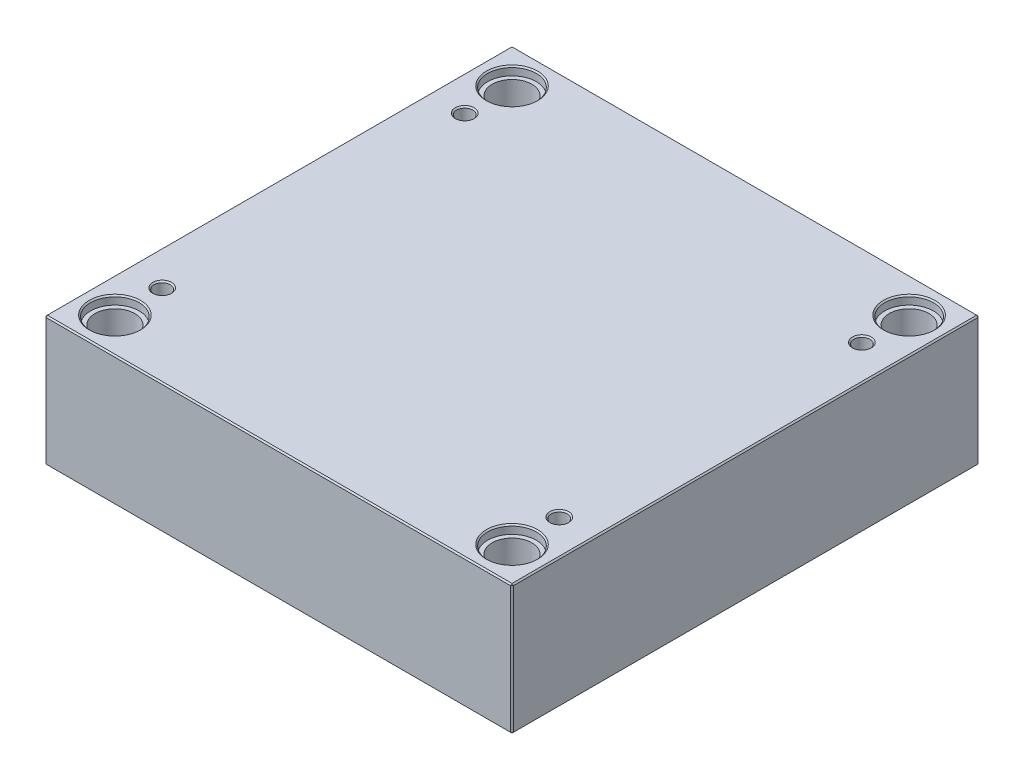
ISO-10303-21;
HEADER;
FILE_DESCRIPTION(('STEP AP214'),'2;1');
FILE_NAME('part.step','',(''),(''),'','','');
FILE_SCHEMA(('AUTOMOTIVE_DESIGN { 1 0 10303 214 1 1 1 1 }'));
ENDSEC;
DATA;
#1=APPLICATION_CONTEXT('core data for automotive mechanical design processes');
#2=APPLICATION_PROTOCOL_DEFINITION('international standard','automotive_design',2000,#1);
#3=PRODUCT_CONTEXT('',#1,'mechanical');
#4=PRODUCT('Part','Part','',(#3));
#5=PRODUCT_RELATED_PRODUCT_CATEGORY('part','',(#4));
#6=PRODUCT_DEFINITION_FORMATION('','',#4);
#7=PRODUCT_DEFINITION_CONTEXT('part definition',#1,'design');
#8=PRODUCT_DEFINITION('design','',#6,#7);
#9=PRODUCT_DEFINITION_SHAPE('','',#8);
#10=(LENGTH_UNIT() NAMED_UNIT(*) SI_UNIT(.MILLI.,.METRE.));
#11=(NAMED_UNIT(*) PLANE_ANGLE_UNIT() SI_UNIT($,.RADIAN.));
#12=(NAMED_UNIT(*) SI_UNIT($,.STERADIAN.) SOLID_ANGLE_UNIT());
#13=UNCERTAINTY_MEASURE_WITH_UNIT(LENGTH_MEASURE(1.E-05),#10,'distance_accuracy_value','');
#14=(GEOMETRIC_REPRESENTATION_CONTEXT(3) GLOBAL_UNCERTAINTY_ASSIGNED_CONTEXT((#13)) GLOBAL_UNIT_ASSIGNED_CONTEXT((#10,
#11,#12)) REPRESENTATION_CONTEXT('',''));
#15=CARTESIAN_POINT('',(0.,0.,0.));
#16=DIRECTION('',(0.,0.,1.));
#17=DIRECTION('',(1.,0.,0.));
#18=AXIS2_PLACEMENT_3D('',#15,#16,#17);
#19=CARTESIAN_POINT('',(-147.,0.,-147.));
#20=DIRECTION('',(0.,1.,0.));
#21=DIRECTION('',(0.,0.,1.));
#22=AXIS2_PLACEMENT_3D('',#19,#20,#21);
#23=CYLINDRICAL_SURFACE('',#22,14.7);
#24=CARTESIAN_POINT('',(-147.,0.999999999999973,-147.));
#25=DIRECTION('',(0.,1.,0.));
#26=DIRECTION('',(0.,0.,1.));
#27=AXIS2_PLACEMENT_3D('',#24,#25,#26);
#28=CIRCLE('',#27,14.7);
#29=CARTESIAN_POINT('',(-147.,0.999999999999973,-132.3));
#30=VERTEX_POINT('',#29);
#31=EDGE_CURVE('E471',#30,#30,#28,.F.);
#32=ORIENTED_EDGE('',*,*,#31,.T.);
#33=EDGE_LOOP('',(#32));
#34=FACE_BOUND('',#33,.T.);
#35=CARTESIAN_POINT('',(-147.,89.7,-147.));
#36=DIRECTION('',(0.,1.,0.));
#37=DIRECTION('',(0.,0.,1.));
#38=AXIS2_PLACEMENT_3D('',#35,#36,#37);
#39=CIRCLE('',#38,14.7);
#40=CARTESIAN_POINT('',(-147.,89.7,-132.3));
#41=VERTEX_POINT('',#40);
#42=EDGE_CURVE('E220',#41,#41,#39,.F.);
#43=ORIENTED_EDGE('',*,*,#42,.F.);
#44=EDGE_LOOP('',(#43));
#45=FACE_BOUND('',#44,.T.);
#46=ADVANCED_FACE('F15',(#34,#45),#23,.F.);
#47=CARTESIAN_POINT('',(147.,0.,-147.));
#48=DIRECTION('',(0.,1.,0.));
#49=DIRECTION('',(0.,0.,1.));
#50=AXIS2_PLACEMENT_3D('',#47,#48,#49);
#51=CYLINDRICAL_SURFACE('',#50,14.7);
#52=CARTESIAN_POINT('',(147.,0.999999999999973,-147.));
#53=DIRECTION('',(0.,1.,0.));
#54=DIRECTION('',(0.,0.,1.));
#55=AXIS2_PLACEMENT_3D('',#52,#53,#54);
#56=CIRCLE('',#55,14.7);
#57=CARTESIAN_POINT('',(147.,0.999999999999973,-132.3));
#58=VERTEX_POINT('',#57);
#59=EDGE_CURVE('E473',#58,#58,#56,.F.);
#60=ORIENTED_EDGE('',*,*,#59,.T.);
#61=EDGE_LOOP('',(#60));
#62=FACE_BOUND('',#61,.T.);
#63=CARTESIAN_POINT('',(147.,89.7,-147.));
#64=DIRECTION('',(0.,1.,0.));
#65=DIRECTION('',(0.,0.,1.));
#66=AXIS2_PLACEMENT_3D('',#63,#64,#65);
#67=CIRCLE('',#66,14.7);
#68=CARTESIAN_POINT('',(147.,89.7,-132.3));
#69=VERTEX_POINT('',#68);
#70=EDGE_CURVE('E217',#69,#69,#67,.F.);
#71=ORIENTED_EDGE('',*,*,#70,.F.);
#72=EDGE_LOOP('',(#71));
#73=FACE_BOUND('',#72,.T.);
#74=ADVANCED_FACE('F262',(#62,#73),#51,.F.);
#75=CARTESIAN_POINT('',(147.,0.,147.));
#76=DIRECTION('',(0.,1.,0.));
#77=DIRECTION('',(0.,0.,1.));
#78=AXIS2_PLACEMENT_3D('',#75,#76,#77);
#79=CYLINDRICAL_SURFACE('',#78,14.7);
#80=CARTESIAN_POINT('',(147.,0.999999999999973,147.));
#81=DIRECTION('',(0.,1.,0.));
#82=DIRECTION('',(0.,0.,1.));
#83=AXIS2_PLACEMENT_3D('',#80,#81,#82);
#84=CIRCLE('',#83,14.7);
#85=CARTESIAN_POINT('',(147.,0.999999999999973,161.7));
#86=VERTEX_POINT('',#85);
#87=EDGE_CURVE('E476',#86,#86,#84,.F.);
#88=ORIENTED_EDGE('',*,*,#87,.T.);
#89=EDGE_LOOP('',(#88));
#90=FACE_BOUND('',#89,.T.);
#91=CARTESIAN_POINT('',(147.,89.7,147.));
#92=DIRECTION('',(0.,1.,0.));
#93=DIRECTION('',(0.,0.,1.));
#94=AXIS2_PLACEMENT_3D('',#91,#92,#93);
#95=CIRCLE('',#94,14.7);
#96=CARTESIAN_POINT('',(147.,89.7,161.7));
#97=VERTEX_POINT('',#96);
#98=EDGE_CURVE('E213',#97,#97,#95,.F.);
#99=ORIENTED_EDGE('',*,*,#98,.F.);
#100=EDGE_LOOP('',(#99));
#101=FACE_BOUND('',#100,.T.);
#102=ADVANCED_FACE('F269',(#90,#101),#79,.F.);
#103=CARTESIAN_POINT('',(-147.,0.,147.));
#104=DIRECTION('',(0.,1.,0.));
#105=DIRECTION('',(0.,0.,1.));
#106=AXIS2_PLACEMENT_3D('',#103,#104,#105);
#107=CYLINDRICAL_SURFACE('',#106,14.7);
#108=CARTESIAN_POINT('',(-147.,0.999999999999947,147.));
#109=DIRECTION('',(0.,1.,0.));
#110=DIRECTION('',(0.,0.,1.));
#111=AXIS2_PLACEMENT_3D('',#108,#109,#110);
#112=CIRCLE('',#111,14.7);
#113=CARTESIAN_POINT('',(-147.,0.999999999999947,161.7));
#114=VERTEX_POINT('',#113);
#115=EDGE_CURVE('E479',#114,#114,#112,.F.);
#116=ORIENTED_EDGE('',*,*,#115,.T.);
#117=EDGE_LOOP('',(#116));
#118=FACE_BOUND('',#117,.T.);
#119=CARTESIAN_POINT('',(-147.,89.7,147.));
#120=DIRECTION('',(0.,1.,0.));
#121=DIRECTION('',(0.,0.,1.));
#122=AXIS2_PLACEMENT_3D('',#119,#120,#121);
#123=CIRCLE('',#122,14.7);
#124=CARTESIAN_POINT('',(-147.,89.7,161.7));
#125=VERTEX_POINT('',#124);
#126=EDGE_CURVE('E210',#125,#125,#123,.F.);
#127=ORIENTED_EDGE('',*,*,#126,.F.);
#128=EDGE_LOOP('',(#127));
#129=FACE_BOUND('',#128,.T.);
#130=ADVANCED_FACE('F276',(#118,#129),#107,.F.);
#131=CARTESIAN_POINT('',(-173.,96.,173.));
#132=DIRECTION('',(1.,0.,0.));
#133=DIRECTION('',(0.,0.,-1.));
#134=AXIS2_PLACEMENT_3D('',#131,#132,#133);
#135=PLANE('',#134);
#136=DIRECTION('',(0.,-1.,0.));
#137=VECTOR('',#136,1.);
#138=CARTESIAN_POINT('',(-173.,96.,-172.));
#139=LINE('',#138,#137);
#140=CARTESIAN_POINT('',(-173.,95.,-172.));
#141=VERTEX_POINT('',#140);
#142=CARTESIAN_POINT('',(-173.,0.999999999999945,-172.));
#143=VERTEX_POINT('',#142);
#144=EDGE_CURVE('E486',#141,#143,#139,.T.);
#145=ORIENTED_EDGE('',*,*,#144,.T.);
#146=DIRECTION('',(0.,0.,1.));
#147=VECTOR('',#146,1.);
#148=CARTESIAN_POINT('',(-173.,0.999999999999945,173.));
#149=LINE('',#148,#147);
#150=CARTESIAN_POINT('',(-173.,0.999999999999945,172.));
#151=VERTEX_POINT('',#150);
#152=EDGE_CURVE('E489',#143,#151,#149,.T.);
#153=ORIENTED_EDGE('',*,*,#152,.T.);
#154=DIRECTION('',(0.,1.,0.));
#155=VECTOR('',#154,1.);
#156=CARTESIAN_POINT('',(-173.,96.,172.));
#157=LINE('',#156,#155);
#158=CARTESIAN_POINT('',(-173.,95.,172.));
#159=VERTEX_POINT('',#158);
#160=EDGE_CURVE('E484',#151,#159,#157,.T.);
#161=ORIENTED_EDGE('',*,*,#160,.T.);
#162=DIRECTION('',(0.,0.,-1.));
#163=VECTOR('',#162,1.);
#164=CARTESIAN_POINT('',(-173.,95.,-173.));
#165=LINE('',#164,#163);
#166=EDGE_CURVE('E482',#159,#141,#165,.T.);
#167=ORIENTED_EDGE('',*,*,#166,.T.);
#168=EDGE_LOOP('',(#145,#153,#161,#167));
#169=FACE_BOUND('',#168,.T.);
#170=ADVANCED_FACE('F297',(#169),#135,.F.);
#171=CARTESIAN_POINT('',(173.,96.,173.));
#172=DIRECTION('',(0.,0.,-1.));
#173=DIRECTION('',(-1.,0.,0.));
#174=AXIS2_PLACEMENT_3D('',#171,#172,#173);
#175=PLANE('',#174);
#176=DIRECTION('',(-1.,0.,0.));
#177=VECTOR('',#176,1.);
#178=CARTESIAN_POINT('',(-173.,95.,173.));
#179=LINE('',#178,#177);
#180=CARTESIAN_POINT('',(172.,95.,173.));
#181=VERTEX_POINT('',#180);
#182=CARTESIAN_POINT('',(-172.,95.,173.));
#183=VERTEX_POINT('',#182);
#184=EDGE_CURVE('E508',#181,#183,#179,.T.);
#185=ORIENTED_EDGE('',*,*,#184,.T.);
#186=DIRECTION('',(0.,-1.,0.));
#187=VECTOR('',#186,1.);
#188=CARTESIAN_POINT('',(-172.,96.,173.));
#189=LINE('',#188,#187);
#190=CARTESIAN_POINT('',(-172.,0.999999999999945,173.));
#191=VERTEX_POINT('',#190);
#192=EDGE_CURVE('E514',#183,#191,#189,.T.);
#193=ORIENTED_EDGE('',*,*,#192,.T.);
#194=DIRECTION('',(1.,0.,0.));
#195=VECTOR('',#194,1.);
#196=CARTESIAN_POINT('',(173.,0.999999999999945,173.));
#197=LINE('',#196,#195);
#198=CARTESIAN_POINT('',(172.,0.999999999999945,173.));
#199=VERTEX_POINT('',#198);
#200=EDGE_CURVE('E512',#191,#199,#197,.T.);
#201=ORIENTED_EDGE('',*,*,#200,.T.);
#202=DIRECTION('',(0.,1.,0.));
#203=VECTOR('',#202,1.);
#204=CARTESIAN_POINT('',(172.,96.,173.));
#205=LINE('',#204,#203);
#206=EDGE_CURVE('E510',#199,#181,#205,.T.);
#207=ORIENTED_EDGE('',*,*,#206,.T.);
#208=EDGE_LOOP('',(#185,#193,#201,#207));
#209=FACE_BOUND('',#208,.T.);
#210=ADVANCED_FACE('F293',(#209),#175,.F.);
#211=CARTESIAN_POINT('',(173.,96.,173.));
#212=DIRECTION('',(-1.,0.,0.));
#213=DIRECTION('',(0.,0.,1.));
#214=AXIS2_PLACEMENT_3D('',#211,#212,#213);
#215=PLANE('',#214);
#216=DIRECTION('',(0.,0.,-1.));
#217=VECTOR('',#216,1.);
#218=CARTESIAN_POINT('',(173.,0.999999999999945,173.));
#219=LINE('',#218,#217);
#220=CARTESIAN_POINT('',(173.,0.999999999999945,172.));
#221=VERTEX_POINT('',#220);
#222=CARTESIAN_POINT('',(173.,0.999999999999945,-172.));
#223=VERTEX_POINT('',#222);
#224=EDGE_CURVE('E503',#221,#223,#219,.T.);
#225=ORIENTED_EDGE('',*,*,#224,.T.);
#226=DIRECTION('',(0.,1.,0.));
#227=VECTOR('',#226,1.);
#228=CARTESIAN_POINT('',(173.,96.,-172.));
#229=LINE('',#228,#227);
#230=CARTESIAN_POINT('',(173.,95.,-172.));
#231=VERTEX_POINT('',#230);
#232=EDGE_CURVE('E505',#223,#231,#229,.T.);
#233=ORIENTED_EDGE('',*,*,#232,.T.);
#234=DIRECTION('',(0.,0.,1.));
#235=VECTOR('',#234,1.);
#236=CARTESIAN_POINT('',(173.,95.,173.));
#237=LINE('',#236,#235);
#238=CARTESIAN_POINT('',(173.,95.,172.));
#239=VERTEX_POINT('',#238);
#240=EDGE_CURVE('E499',#231,#239,#237,.T.);
#241=ORIENTED_EDGE('',*,*,#240,.T.);
#242=DIRECTION('',(0.,-1.,0.));
#243=VECTOR('',#242,1.);
#244=CARTESIAN_POINT('',(173.,96.,172.));
#245=LINE('',#244,#243);
#246=EDGE_CURVE('E501',#239,#221,#245,.T.);
#247=ORIENTED_EDGE('',*,*,#246,.T.);
#248=EDGE_LOOP('',(#225,#233,#241,#247));
#249=FACE_BOUND('',#248,.T.);
#250=ADVANCED_FACE('F289',(#249),#215,.F.);
#251=CARTESIAN_POINT('',(173.,96.,-173.));
#252=DIRECTION('',(0.,0.,1.));
#253=DIRECTION('',(1.,0.,0.));
#254=AXIS2_PLACEMENT_3D('',#251,#252,#253);
#255=PLANE('',#254);
#256=DIRECTION('',(0.,-1.,0.));
#257=VECTOR('',#256,1.);
#258=CARTESIAN_POINT('',(172.,96.,-173.));
#259=LINE('',#258,#257);
#260=CARTESIAN_POINT('',(172.,95.,-173.));
#261=VERTEX_POINT('',#260);
#262=CARTESIAN_POINT('',(172.,0.999999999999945,-173.));
#263=VERTEX_POINT('',#262);
#264=EDGE_CURVE('E493',#261,#263,#259,.T.);
#265=ORIENTED_EDGE('',*,*,#264,.T.);
#266=DIRECTION('',(-1.,0.,0.));
#267=VECTOR('',#266,1.);
#268=CARTESIAN_POINT('',(173.,0.999999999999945,-173.));
#269=LINE('',#268,#267);
#270=CARTESIAN_POINT('',(-172.,0.999999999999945,-173.));
#271=VERTEX_POINT('',#270);
#272=EDGE_CURVE('E137',#263,#271,#269,.T.);
#273=ORIENTED_EDGE('',*,*,#272,.T.);
#274=DIRECTION('',(0.,1.,0.));
#275=VECTOR('',#274,1.);
#276=CARTESIAN_POINT('',(-172.,96.,-173.));
#277=LINE('',#276,#275);
#278=CARTESIAN_POINT('',(-172.,95.,-173.));
#279=VERTEX_POINT('',#278);
#280=EDGE_CURVE('E495',#271,#279,#277,.T.);
#281=ORIENTED_EDGE('',*,*,#280,.T.);
#282=DIRECTION('',(1.,0.,0.));
#283=VECTOR('',#282,1.);
#284=CARTESIAN_POINT('',(173.,95.,-173.));
#285=LINE('',#284,#283);
#286=EDGE_CURVE('E491',#279,#261,#285,.T.);
#287=ORIENTED_EDGE('',*,*,#286,.T.);
#288=EDGE_LOOP('',(#265,#273,#281,#287));
#289=FACE_BOUND('',#288,.T.);
#290=ADVANCED_FACE('F281',(#289),#255,.F.);
#291=CARTESIAN_POINT('',(0.,96.,0.));
#292=DIRECTION('',(0.,1.,0.));
#293=DIRECTION('',(0.,0.,1.));
#294=AXIS2_PLACEMENT_3D('',#291,#292,#293);
#295=PLANE('',#294);
#296=CARTESIAN_POINT('',(147.,96.,147.));
#297=DIRECTION('',(0.,1.,0.));
#298=DIRECTION('',(0.,0.,1.));
#299=AXIS2_PLACEMENT_3D('',#296,#297,#298);
#300=CIRCLE('',#299,19.);
#301=CARTESIAN_POINT('',(147.,96.,166.));
#302=VERTEX_POINT('',#301);
#303=EDGE_CURVE('E235',#302,#302,#300,.F.);
#304=ORIENTED_EDGE('',*,*,#303,.T.);
#305=EDGE_LOOP('',(#304));
#306=FACE_BOUND('',#305,.T.);
#307=CARTESIAN_POINT('',(-147.,96.,147.));
#308=DIRECTION('',(0.,1.,0.));
#309=DIRECTION('',(0.,0.,1.));
#310=AXIS2_PLACEMENT_3D('',#307,#308,#309);
#311=CIRCLE('',#310,19.);
#312=CARTESIAN_POINT('',(-147.,96.,166.));
#313=VERTEX_POINT('',#312);
#314=EDGE_CURVE('E232',#313,#313,#311,.F.);
#315=ORIENTED_EDGE('',*,*,#314,.T.);
#316=EDGE_LOOP('',(#315));
#317=FACE_BOUND('',#316,.T.);
#318=CARTESIAN_POINT('',(147.,96.,-147.));
#319=DIRECTION('',(0.,1.,0.));
#320=DIRECTION('',(0.,0.,1.));
#321=AXIS2_PLACEMENT_3D('',#318,#319,#320);
#322=CIRCLE('',#321,19.);
#323=CARTESIAN_POINT('',(147.,96.,-128.));
#324=VERTEX_POINT('',#323);
#325=EDGE_CURVE('E229',#324,#324,#322,.F.);
#326=ORIENTED_EDGE('',*,*,#325,.T.);
#327=EDGE_LOOP('',(#326));
#328=FACE_BOUND('',#327,.T.);
#329=CARTESIAN_POINT('',(-147.,96.,-147.));
#330=DIRECTION('',(0.,1.,0.));
#331=DIRECTION('',(0.,0.,1.));
#332=AXIS2_PLACEMENT_3D('',#329,#330,#331);
#333=CIRCLE('',#332,19.);
#334=CARTESIAN_POINT('',(-147.,96.,-128.));
#335=VERTEX_POINT('',#334);
#336=EDGE_CURVE('E226',#335,#335,#333,.F.);
#337=ORIENTED_EDGE('',*,*,#336,.T.);
#338=EDGE_LOOP('',(#337));
#339=FACE_BOUND('',#338,.T.);
#340=CARTESIAN_POINT('',(-147.,96.,112.));
#341=DIRECTION('',(0.,1.,0.));
#342=DIRECTION('',(0.,0.,1.));
#343=AXIS2_PLACEMENT_3D('',#340,#341,#342);
#344=CIRCLE('',#343,7.);
#345=CARTESIAN_POINT('',(-147.,96.,119.));
#346=VERTEX_POINT('',#345);
#347=EDGE_CURVE('E197',#346,#346,#344,.F.);
#348=ORIENTED_EDGE('',*,*,#347,.T.);
#349=EDGE_LOOP('',(#348));
#350=FACE_BOUND('',#349,.T.);
#351=CARTESIAN_POINT('',(147.,96.,112.));
#352=DIRECTION('',(0.,1.,0.));
#353=DIRECTION('',(0.,0.,1.));
#354=AXIS2_PLACEMENT_3D('',#351,#352,#353);
#355=CIRCLE('',#354,7.00000000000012);
#356=CARTESIAN_POINT('',(147.,96.,119.));
#357=VERTEX_POINT('',#356);
#358=EDGE_CURVE('E194',#357,#357,#355,.F.);
#359=ORIENTED_EDGE('',*,*,#358,.T.);
#360=EDGE_LOOP('',(#359));
#361=FACE_BOUND('',#360,.T.);
#362=CARTESIAN_POINT('',(147.,96.,-112.));
#363=DIRECTION('',(0.,1.,0.));
#364=DIRECTION('',(0.,0.,1.));
#365=AXIS2_PLACEMENT_3D('',#362,#363,#364);
#366=CIRCLE('',#365,7.00000000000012);
#367=CARTESIAN_POINT('',(147.,96.,-105.));
#368=VERTEX_POINT('',#367);
#369=EDGE_CURVE('E191',#368,#368,#366,.F.);
#370=ORIENTED_EDGE('',*,*,#369,.T.);
#371=EDGE_LOOP('',(#370));
#372=FACE_BOUND('',#371,.T.);
#373=CARTESIAN_POINT('',(-147.,96.,-112.));
#374=DIRECTION('',(0.,1.,0.));
#375=DIRECTION('',(0.,0.,1.));
#376=AXIS2_PLACEMENT_3D('',#373,#374,#375);
#377=CIRCLE('',#376,7.00000000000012);
#378=CARTESIAN_POINT('',(-147.,96.,-105.));
#379=VERTEX_POINT('',#378);
#380=EDGE_CURVE('E187',#379,#379,#377,.F.);
#381=ORIENTED_EDGE('',*,*,#380,.T.);
#382=EDGE_LOOP('',(#381));
#383=FACE_BOUND('',#382,.T.);
#384=DIRECTION('',(0.,0.,-1.));
#385=VECTOR('',#384,1.);
#386=CARTESIAN_POINT('',(172.,96.,-173.));
#387=LINE('',#386,#385);
#388=CARTESIAN_POINT('',(172.,96.,172.));
#389=VERTEX_POINT('',#388);
#390=CARTESIAN_POINT('',(172.,96.,-172.));
#391=VERTEX_POINT('',#390);
#392=EDGE_CURVE('E30',#389,#391,#387,.T.);
#393=ORIENTED_EDGE('',*,*,#392,.T.);
#394=DIRECTION('',(-1.,0.,0.));
#395=VECTOR('',#394,1.);
#396=CARTESIAN_POINT('',(-173.,96.,-172.));
#397=LINE('',#396,#395);
#398=CARTESIAN_POINT('',(-172.,96.,-172.));
#399=VERTEX_POINT('',#398);
#400=EDGE_CURVE('E188',#391,#399,#397,.T.);
#401=ORIENTED_EDGE('',*,*,#400,.T.);
#402=DIRECTION('',(0.,0.,1.));
#403=VECTOR('',#402,1.);
#404=CARTESIAN_POINT('',(-172.,96.,173.));
#405=LINE('',#404,#403);
#406=CARTESIAN_POINT('',(-172.,96.,172.));
#407=VERTEX_POINT('',#406);
#408=EDGE_CURVE('E517',#399,#407,#405,.T.);
#409=ORIENTED_EDGE('',*,*,#408,.T.);
#410=DIRECTION('',(1.,0.,0.));
#411=VECTOR('',#410,1.);
#412=CARTESIAN_POINT('',(173.,96.,172.));
#413=LINE('',#412,#411);
#414=EDGE_CURVE('E35',#407,#389,#413,.T.);
#415=ORIENTED_EDGE('',*,*,#414,.T.);
#416=EDGE_LOOP('',(#393,#401,#409,#415));
#417=FACE_BOUND('',#416,.T.);
#418=ADVANCED_FACE('F278',(#306,#317,#328,#339,#350,#361,#372,#383,#417),#295,.T.);
#419=CARTESIAN_POINT('',(0.,0.,0.));
#420=DIRECTION('',(0.,1.,0.));
#421=DIRECTION('',(0.,0.,1.));
#422=AXIS2_PLACEMENT_3D('',#419,#420,#421);
#423=PLANE('',#422);
#424=CARTESIAN_POINT('',(-147.,0.,-147.));
#425=DIRECTION('',(0.,1.,0.));
#426=DIRECTION('',(0.,0.,1.));
#427=AXIS2_PLACEMENT_3D('',#424,#425,#426);
#428=CIRCLE('',#427,15.7);
#429=CARTESIAN_POINT('',(-147.,0.,-131.3));
#430=VERTEX_POINT('',#429);
#431=EDGE_CURVE('E468',#430,#430,#428,.T.);
#432=ORIENTED_EDGE('',*,*,#431,.T.);
#433=EDGE_LOOP('',(#432));
#434=FACE_BOUND('',#433,.T.);
#435=CARTESIAN_POINT('',(147.,0.,-147.));
#436=DIRECTION('',(0.,1.,0.));
#437=DIRECTION('',(0.,0.,1.));
#438=AXIS2_PLACEMENT_3D('',#435,#436,#437);
#439=CIRCLE('',#438,15.7);
#440=CARTESIAN_POINT('',(147.,0.,-131.3));
#441=VERTEX_POINT('',#440);
#442=EDGE_CURVE('E465',#441,#441,#439,.T.);
#443=ORIENTED_EDGE('',*,*,#442,.T.);
#444=EDGE_LOOP('',(#443));
#445=FACE_BOUND('',#444,.T.);
#446=CARTESIAN_POINT('',(147.,0.,147.));
#447=DIRECTION('',(0.,1.,0.));
#448=DIRECTION('',(0.,0.,1.));
#449=AXIS2_PLACEMENT_3D('',#446,#447,#448);
#450=CIRCLE('',#449,15.7);
#451=CARTESIAN_POINT('',(147.,0.,162.7));
#452=VERTEX_POINT('',#451);
#453=EDGE_CURVE('E462',#452,#452,#450,.T.);
#454=ORIENTED_EDGE('',*,*,#453,.T.);
#455=EDGE_LOOP('',(#454));
#456=FACE_BOUND('',#455,.T.);
#457=CARTESIAN_POINT('',(-147.,0.,147.));
#458=DIRECTION('',(0.,1.,0.));
#459=DIRECTION('',(0.,0.,1.));
#460=AXIS2_PLACEMENT_3D('',#457,#458,#459);
#461=CIRCLE('',#460,15.7);
#462=CARTESIAN_POINT('',(-147.,0.,162.7));
#463=VERTEX_POINT('',#462);
#464=EDGE_CURVE('E459',#463,#463,#461,.T.);
#465=ORIENTED_EDGE('',*,*,#464,.T.);
#466=EDGE_LOOP('',(#465));
#467=FACE_BOUND('',#466,.T.);
#468=DIRECTION('',(0.,0.,1.));
#469=VECTOR('',#468,1.);
#470=CARTESIAN_POINT('',(172.,0.,0.));
#471=LINE('',#470,#469);
#472=CARTESIAN_POINT('',(172.,0.,-172.));
#473=VERTEX_POINT('',#472);
#474=CARTESIAN_POINT('',(172.,0.,172.));
#475=VERTEX_POINT('',#474);
#476=EDGE_CURVE('E107',#473,#475,#471,.T.);
#477=ORIENTED_EDGE('',*,*,#476,.T.);
#478=DIRECTION('',(-1.,0.,0.));
#479=VECTOR('',#478,1.);
#480=CARTESIAN_POINT('',(0.,0.,172.));
#481=LINE('',#480,#479);
#482=CARTESIAN_POINT('',(-172.,0.,172.));
#483=VERTEX_POINT('',#482);
#484=EDGE_CURVE('E457',#475,#483,#481,.T.);
#485=ORIENTED_EDGE('',*,*,#484,.T.);
#486=DIRECTION('',(0.,0.,-1.));
#487=VECTOR('',#486,1.);
#488=CARTESIAN_POINT('',(-172.,0.,0.));
#489=LINE('',#488,#487);
#490=CARTESIAN_POINT('',(-172.,0.,-172.));
#491=VERTEX_POINT('',#490);
#492=EDGE_CURVE('E109',#483,#491,#489,.T.);
#493=ORIENTED_EDGE('',*,*,#492,.T.);
#494=DIRECTION('',(1.,0.,0.));
#495=VECTOR('',#494,1.);
#496=CARTESIAN_POINT('',(0.,0.,-172.));
#497=LINE('',#496,#495);
#498=EDGE_CURVE('E103',#491,#473,#497,.T.);
#499=ORIENTED_EDGE('',*,*,#498,.T.);
#500=EDGE_LOOP('',(#477,#485,#493,#499));
#501=FACE_BOUND('',#500,.T.);
#502=ADVANCED_FACE('F105',(#434,#445,#456,#467,#501),#423,.F.);
#503=CARTESIAN_POINT('',(-147.,0.,-147.));
#504=DIRECTION('',(0.,-1.,0.));
#505=DIRECTION('',(0.,0.,-1.));
#506=AXIS2_PLACEMENT_3D('',#503,#504,#505);
#507=CONICAL_SURFACE('',#506,15.7,0.78539816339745);
#508=ORIENTED_EDGE('',*,*,#31,.F.);
#509=EDGE_LOOP('',(#508));
#510=FACE_BOUND('',#509,.T.);
#511=ORIENTED_EDGE('',*,*,#431,.F.);
#512=EDGE_LOOP('',(#511));
#513=FACE_BOUND('',#512,.T.);
#514=ADVANCED_FACE('F285',(#510,#513),#507,.F.);
#515=CARTESIAN_POINT('',(147.,0.,-147.));
#516=DIRECTION('',(0.,-1.,0.));
#517=DIRECTION('',(0.,0.,-1.));
#518=AXIS2_PLACEMENT_3D('',#515,#516,#517);
#519=CONICAL_SURFACE('',#518,15.7,0.78539816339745);
#520=ORIENTED_EDGE('',*,*,#59,.F.);
#521=EDGE_LOOP('',(#520));
#522=FACE_BOUND('',#521,.T.);
#523=ORIENTED_EDGE('',*,*,#442,.F.);
#524=EDGE_LOOP('',(#523));
#525=FACE_BOUND('',#524,.T.);
#526=ADVANCED_FACE('F304',(#522,#525),#519,.F.);
#527=CARTESIAN_POINT('',(147.,0.,147.));
#528=DIRECTION('',(0.,-1.,0.));
#529=DIRECTION('',(0.,0.,-1.));
#530=AXIS2_PLACEMENT_3D('',#527,#528,#529);
#531=CONICAL_SURFACE('',#530,15.7,0.78539816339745);
#532=ORIENTED_EDGE('',*,*,#87,.F.);
#533=EDGE_LOOP('',(#532));
#534=FACE_BOUND('',#533,.T.);
#535=ORIENTED_EDGE('',*,*,#453,.F.);
#536=EDGE_LOOP('',(#535));
#537=FACE_BOUND('',#536,.T.);
#538=ADVANCED_FACE('F308',(#534,#537),#531,.F.);
#539=CARTESIAN_POINT('',(-147.,0.,147.));
#540=DIRECTION('',(0.,-1.,0.));
#541=DIRECTION('',(0.,0.,-1.));
#542=AXIS2_PLACEMENT_3D('',#539,#540,#541);
#543=CONICAL_SURFACE('',#542,15.7,0.78539816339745);
#544=ORIENTED_EDGE('',*,*,#115,.F.);
#545=EDGE_LOOP('',(#544));
#546=FACE_BOUND('',#545,.T.);
#547=ORIENTED_EDGE('',*,*,#464,.F.);
#548=EDGE_LOOP('',(#547));
#549=FACE_BOUND('',#548,.T.);
#550=ADVANCED_FACE('F312',(#546,#549),#543,.F.);
#551=CARTESIAN_POINT('',(173.,96.,172.));
#552=DIRECTION('',(-0.707106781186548,0.,-0.707106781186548));
#553=DIRECTION('',(0.,-1.,0.));
#554=AXIS2_PLACEMENT_3D('',#551,#552,#553);
#555=PLANE('',#554);
#556=DIRECTION('',(-0.707106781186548,0.,0.707106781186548));
#557=VECTOR('',#556,1.);
#558=CARTESIAN_POINT('',(172.,95.,173.));
#559=LINE('',#558,#557);
#560=EDGE_CURVE('E125',#181,#239,#559,.F.);
#561=ORIENTED_EDGE('',*,*,#560,.F.);
#562=ORIENTED_EDGE('',*,*,#206,.F.);
#563=DIRECTION('',(0.707106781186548,0.,-0.707106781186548));
#564=VECTOR('',#563,1.);
#565=CARTESIAN_POINT('',(172.,0.999999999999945,173.));
#566=LINE('',#565,#564);
#567=EDGE_CURVE('E179',#221,#199,#566,.F.);
#568=ORIENTED_EDGE('',*,*,#567,.F.);
#569=ORIENTED_EDGE('',*,*,#246,.F.);
#570=EDGE_LOOP('',(#561,#562,#568,#569));
#571=FACE_BOUND('',#570,.T.);
#572=ADVANCED_FACE('F316',(#571),#555,.F.);
#573=CARTESIAN_POINT('',(172.,95.,173.));
#574=DIRECTION('',(0.57735026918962,0.577350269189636,0.57735026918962));
#575=DIRECTION('',(0.,-0.707106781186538,0.707106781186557));
#576=AXIS2_PLACEMENT_3D('',#573,#574,#575);
#577=PLANE('',#576);
#578=DIRECTION('',(0.,-0.707106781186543,0.707106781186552));
#579=VECTOR('',#578,1.);
#580=CARTESIAN_POINT('',(172.,95.,173.));
#581=LINE('',#580,#579);
#582=EDGE_CURVE('E174',#181,#389,#581,.F.);
#583=ORIENTED_EDGE('',*,*,#582,.F.);
#584=ORIENTED_EDGE('',*,*,#560,.T.);
#585=DIRECTION('',(-0.707106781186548,0.707106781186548,0.));
#586=VECTOR('',#585,1.);
#587=CARTESIAN_POINT('',(172.5,95.5,172.));
#588=LINE('',#587,#586);
#589=EDGE_CURVE('E176',#389,#239,#588,.F.);
#590=ORIENTED_EDGE('',*,*,#589,.F.);
#591=EDGE_LOOP('',(#583,#584,#590));
#592=FACE_BOUND('',#591,.T.);
#593=ADVANCED_FACE('F384',(#592),#577,.T.);
#594=CARTESIAN_POINT('',(172.,0.999999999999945,173.));
#595=DIRECTION('',(0.577350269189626,-0.577350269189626,0.577350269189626));
#596=DIRECTION('',(0.707106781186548,0.,-0.707106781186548));
#597=AXIS2_PLACEMENT_3D('',#594,#595,#596);
#598=PLANE('',#597);
#599=DIRECTION('',(-0.707106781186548,-0.707106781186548,0.));
#600=VECTOR('',#599,1.);
#601=CARTESIAN_POINT('',(172.5,0.499999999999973,172.));
#602=LINE('',#601,#600);
#603=EDGE_CURVE('E123',#221,#475,#602,.T.);
#604=ORIENTED_EDGE('',*,*,#603,.F.);
#605=ORIENTED_EDGE('',*,*,#567,.T.);
#606=DIRECTION('',(0.,0.707106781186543,0.707106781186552));
#607=VECTOR('',#606,1.);
#608=CARTESIAN_POINT('',(172.,0.999999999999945,173.));
#609=LINE('',#608,#607);
#610=EDGE_CURVE('E171',#475,#199,#609,.T.);
#611=ORIENTED_EDGE('',*,*,#610,.F.);
#612=EDGE_LOOP('',(#604,#605,#611));
#613=FACE_BOUND('',#612,.T.);
#614=ADVANCED_FACE('F380',(#613),#598,.T.);
#615=CARTESIAN_POINT('',(172.,96.,0.));
#616=DIRECTION('',(0.707106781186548,0.707106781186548,0.));
#617=DIRECTION('',(0.,0.,1.));
#618=AXIS2_PLACEMENT_3D('',#615,#616,#617);
#619=PLANE('',#618);
#620=ORIENTED_EDGE('',*,*,#589,.T.);
#621=ORIENTED_EDGE('',*,*,#240,.F.);
#622=DIRECTION('',(0.707106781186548,-0.707106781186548,0.));
#623=VECTOR('',#622,1.);
#624=CARTESIAN_POINT('',(173.,95.,-172.));
#625=LINE('',#624,#623);
#626=EDGE_CURVE('E165',#391,#231,#625,.T.);
#627=ORIENTED_EDGE('',*,*,#626,.F.);
#628=ORIENTED_EDGE('',*,*,#392,.F.);
#629=EDGE_LOOP('',(#620,#621,#627,#628));
#630=FACE_BOUND('',#629,.T.);
#631=ADVANCED_FACE('F376',(#630),#619,.T.);
#632=CARTESIAN_POINT('',(0.,96.,172.));
#633=DIRECTION('',(0.,0.707106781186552,0.707106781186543));
#634=DIRECTION('',(-1.,0.,0.));
#635=AXIS2_PLACEMENT_3D('',#632,#633,#634);
#636=PLANE('',#635);
#637=ORIENTED_EDGE('',*,*,#582,.T.);
#638=ORIENTED_EDGE('',*,*,#414,.F.);
#639=DIRECTION('',(0.,0.707106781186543,-0.707106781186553));
#640=VECTOR('',#639,1.);
#641=CARTESIAN_POINT('',(-172.,95.5,172.5));
#642=LINE('',#641,#640);
#643=EDGE_CURVE('E162',#183,#407,#642,.T.);
#644=ORIENTED_EDGE('',*,*,#643,.F.);
#645=ORIENTED_EDGE('',*,*,#184,.F.);
#646=EDGE_LOOP('',(#637,#638,#644,#645));
#647=FACE_BOUND('',#646,.T.);
#648=ADVANCED_FACE('F372',(#647),#636,.T.);
#649=CARTESIAN_POINT('',(-172.,96.,173.));
#650=DIRECTION('',(0.707106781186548,0.,-0.707106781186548));
#651=DIRECTION('',(0.,-1.,0.));
#652=AXIS2_PLACEMENT_3D('',#649,#650,#651);
#653=PLANE('',#652);
#654=DIRECTION('',(0.707106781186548,0.,0.707106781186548));
#655=VECTOR('',#654,1.);
#656=CARTESIAN_POINT('',(-172.,0.999999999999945,173.));
#657=LINE('',#656,#655);
#658=EDGE_CURVE('E156',#191,#151,#657,.F.);
#659=ORIENTED_EDGE('',*,*,#658,.F.);
#660=ORIENTED_EDGE('',*,*,#192,.F.);
#661=DIRECTION('',(-0.707106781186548,0.,-0.707106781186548));
#662=VECTOR('',#661,1.);
#663=CARTESIAN_POINT('',(-173.,95.,172.));
#664=LINE('',#663,#662);
#665=EDGE_CURVE('E159',#159,#183,#664,.F.);
#666=ORIENTED_EDGE('',*,*,#665,.F.);
#667=ORIENTED_EDGE('',*,*,#160,.F.);
#668=EDGE_LOOP('',(#659,#660,#666,#667));
#669=FACE_BOUND('',#668,.T.);
#670=ADVANCED_FACE('F368',(#669),#653,.F.);
#671=CARTESIAN_POINT('',(173.,0.999999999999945,173.));
#672=DIRECTION('',(0.,0.707106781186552,-0.707106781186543));
#673=DIRECTION('',(1.,0.,0.));
#674=AXIS2_PLACEMENT_3D('',#671,#672,#673);
#675=PLANE('',#674);
#676=ORIENTED_EDGE('',*,*,#610,.T.);
#677=ORIENTED_EDGE('',*,*,#200,.F.);
#678=DIRECTION('',(0.,-0.707106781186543,-0.707106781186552));
#679=VECTOR('',#678,1.);
#680=CARTESIAN_POINT('',(-172.,0.999999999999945,173.));
#681=LINE('',#680,#679);
#682=EDGE_CURVE('E134',#483,#191,#681,.F.);
#683=ORIENTED_EDGE('',*,*,#682,.F.);
#684=ORIENTED_EDGE('',*,*,#484,.F.);
#685=EDGE_LOOP('',(#676,#677,#683,#684));
#686=FACE_BOUND('',#685,.T.);
#687=ADVANCED_FACE('F365',(#686),#675,.F.);
#688=CARTESIAN_POINT('',(173.,0.999999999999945,173.));
#689=DIRECTION('',(-0.707106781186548,0.707106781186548,0.));
#690=DIRECTION('',(0.,0.,-1.));
#691=AXIS2_PLACEMENT_3D('',#688,#689,#690);
#692=PLANE('',#691);
#693=ORIENTED_EDGE('',*,*,#603,.T.);
#694=ORIENTED_EDGE('',*,*,#476,.F.);
#695=DIRECTION('',(0.707106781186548,0.707106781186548,0.));
#696=VECTOR('',#695,1.);
#697=CARTESIAN_POINT('',(172.5,0.499999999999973,-172.));
#698=LINE('',#697,#696);
#699=EDGE_CURVE('E120',#223,#473,#698,.F.);
#700=ORIENTED_EDGE('',*,*,#699,.F.);
#701=ORIENTED_EDGE('',*,*,#224,.F.);
#702=EDGE_LOOP('',(#693,#694,#700,#701));
#703=FACE_BOUND('',#702,.T.);
#704=ADVANCED_FACE('F118',(#703),#692,.F.);
#705=CARTESIAN_POINT('',(172.,96.,-173.));
#706=DIRECTION('',(-0.707106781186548,0.,0.707106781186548));
#707=DIRECTION('',(0.,-1.,0.));
#708=AXIS2_PLACEMENT_3D('',#705,#706,#707);
#709=PLANE('',#708);
#710=DIRECTION('',(0.707106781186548,0.,0.707106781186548));
#711=VECTOR('',#710,1.);
#712=CARTESIAN_POINT('',(173.,95.,-172.));
#713=LINE('',#712,#711);
#714=EDGE_CURVE('E167',#231,#261,#713,.F.);
#715=ORIENTED_EDGE('',*,*,#714,.F.);
#716=ORIENTED_EDGE('',*,*,#232,.F.);
#717=DIRECTION('',(-0.707106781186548,0.,-0.707106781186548));
#718=VECTOR('',#717,1.);
#719=CARTESIAN_POINT('',(172.,0.999999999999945,-173.));
#720=LINE('',#719,#718);
#721=EDGE_CURVE('E133',#263,#223,#720,.F.);
#722=ORIENTED_EDGE('',*,*,#721,.F.);
#723=ORIENTED_EDGE('',*,*,#264,.F.);
#724=EDGE_LOOP('',(#715,#716,#722,#723));
#725=FACE_BOUND('',#724,.T.);
#726=ADVANCED_FACE('F358',(#725),#709,.F.);
#727=CARTESIAN_POINT('',(173.,95.,-172.));
#728=DIRECTION('',(0.577350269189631,0.577350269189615,-0.577350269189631));
#729=DIRECTION('',(-0.707106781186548,0.,-0.707106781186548));
#730=AXIS2_PLACEMENT_3D('',#727,#728,#729);
#731=PLANE('',#730);
#732=ORIENTED_EDGE('',*,*,#626,.T.);
#733=ORIENTED_EDGE('',*,*,#714,.T.);
#734=DIRECTION('',(0.,0.707106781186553,0.707106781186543));
#735=VECTOR('',#734,1.);
#736=CARTESIAN_POINT('',(172.,95.5,-172.5));
#737=LINE('',#736,#735);
#738=EDGE_CURVE('E151',#391,#261,#737,.F.);
#739=ORIENTED_EDGE('',*,*,#738,.F.);
#740=EDGE_LOOP('',(#732,#733,#739));
#741=FACE_BOUND('',#740,.T.);
#742=ADVANCED_FACE('F354',(#741),#731,.T.);
#743=CARTESIAN_POINT('',(-173.,95.,172.));
#744=DIRECTION('',(-0.57735026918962,0.577350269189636,0.57735026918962));
#745=DIRECTION('',(0.,-0.707106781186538,0.707106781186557));
#746=AXIS2_PLACEMENT_3D('',#743,#744,#745);
#747=PLANE('',#746);
#748=ORIENTED_EDGE('',*,*,#665,.T.);
#749=ORIENTED_EDGE('',*,*,#643,.T.);
#750=DIRECTION('',(-0.707106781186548,-0.707106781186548,0.));
#751=VECTOR('',#750,1.);
#752=CARTESIAN_POINT('',(-173.,95.,172.));
#753=LINE('',#752,#751);
#754=EDGE_CURVE('E142',#159,#407,#753,.F.);
#755=ORIENTED_EDGE('',*,*,#754,.F.);
#756=EDGE_LOOP('',(#748,#749,#755));
#757=FACE_BOUND('',#756,.T.);
#758=ADVANCED_FACE('F350',(#757),#747,.T.);
#759=CARTESIAN_POINT('',(-172.,0.999999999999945,173.));
#760=DIRECTION('',(-0.577350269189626,-0.577350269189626,0.577350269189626));
#761=DIRECTION('',(0.707106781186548,0.,0.707106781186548));
#762=AXIS2_PLACEMENT_3D('',#759,#760,#761);
#763=PLANE('',#762);
#764=ORIENTED_EDGE('',*,*,#682,.T.);
#765=ORIENTED_EDGE('',*,*,#658,.T.);
#766=DIRECTION('',(-0.707106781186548,0.707106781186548,0.));
#767=VECTOR('',#766,1.);
#768=CARTESIAN_POINT('',(-172.5,0.499999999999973,172.));
#769=LINE('',#768,#767);
#770=EDGE_CURVE('E138',#483,#151,#769,.T.);
#771=ORIENTED_EDGE('',*,*,#770,.F.);
#772=EDGE_LOOP('',(#764,#765,#771));
#773=FACE_BOUND('',#772,.T.);
#774=ADVANCED_FACE('F347',(#773),#763,.T.);
#775=CARTESIAN_POINT('',(172.,0.999999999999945,-173.));
#776=DIRECTION('',(0.577350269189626,-0.577350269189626,-0.577350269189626));
#777=DIRECTION('',(-0.707106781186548,0.,-0.707106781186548));
#778=AXIS2_PLACEMENT_3D('',#775,#776,#777);
#779=PLANE('',#778);
#780=ORIENTED_EDGE('',*,*,#721,.T.);
#781=ORIENTED_EDGE('',*,*,#699,.T.);
#782=DIRECTION('',(0.,-0.707106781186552,0.707106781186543));
#783=VECTOR('',#782,1.);
#784=CARTESIAN_POINT('',(172.,0.999999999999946,-173.));
#785=LINE('',#784,#783);
#786=EDGE_CURVE('E130',#263,#473,#785,.T.);
#787=ORIENTED_EDGE('',*,*,#786,.F.);
#788=EDGE_LOOP('',(#780,#781,#787));
#789=FACE_BOUND('',#788,.T.);
#790=ADVANCED_FACE('F129',(#789),#779,.T.);
#791=CARTESIAN_POINT('',(0.,96.,-172.));
#792=DIRECTION('',(0.,0.707106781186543,-0.707106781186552));
#793=DIRECTION('',(1.,0.,0.));
#794=AXIS2_PLACEMENT_3D('',#791,#792,#793);
#795=PLANE('',#794);
#796=ORIENTED_EDGE('',*,*,#738,.T.);
#797=ORIENTED_EDGE('',*,*,#286,.F.);
#798=DIRECTION('',(0.,-0.707106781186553,-0.707106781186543));
#799=VECTOR('',#798,1.);
#800=CARTESIAN_POINT('',(-172.,95.,-173.));
#801=LINE('',#800,#799);
#802=EDGE_CURVE('E139',#399,#279,#801,.T.);
#803=ORIENTED_EDGE('',*,*,#802,.F.);
#804=ORIENTED_EDGE('',*,*,#400,.F.);
#805=EDGE_LOOP('',(#796,#797,#803,#804));
#806=FACE_BOUND('',#805,.T.);
#807=ADVANCED_FACE('F340',(#806),#795,.T.);
#808=CARTESIAN_POINT('',(-172.,96.,0.));
#809=DIRECTION('',(-0.707106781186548,0.707106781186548,0.));
#810=DIRECTION('',(0.,0.,-1.));
#811=AXIS2_PLACEMENT_3D('',#808,#809,#810);
#812=PLANE('',#811);
#813=ORIENTED_EDGE('',*,*,#754,.T.);
#814=ORIENTED_EDGE('',*,*,#408,.F.);
#815=DIRECTION('',(0.707106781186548,0.707106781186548,0.));
#816=VECTOR('',#815,1.);
#817=CARTESIAN_POINT('',(-172.5,95.5,-172.));
#818=LINE('',#817,#816);
#819=EDGE_CURVE('E145',#141,#399,#818,.T.);
#820=ORIENTED_EDGE('',*,*,#819,.F.);
#821=ORIENTED_EDGE('',*,*,#166,.F.);
#822=EDGE_LOOP('',(#813,#814,#820,#821));
#823=FACE_BOUND('',#822,.T.);
#824=ADVANCED_FACE('F336',(#823),#812,.T.);
#825=CARTESIAN_POINT('',(-173.,0.999999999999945,173.));
#826=DIRECTION('',(0.707106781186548,0.707106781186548,0.));
#827=DIRECTION('',(0.,0.,1.));
#828=AXIS2_PLACEMENT_3D('',#825,#826,#827);
#829=PLANE('',#828);
#830=ORIENTED_EDGE('',*,*,#770,.T.);
#831=ORIENTED_EDGE('',*,*,#152,.F.);
#832=DIRECTION('',(0.707106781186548,-0.707106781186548,0.));
#833=VECTOR('',#832,1.);
#834=CARTESIAN_POINT('',(-173.,0.999999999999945,-172.));
#835=LINE('',#834,#833);
#836=EDGE_CURVE('E528',#491,#143,#835,.F.);
#837=ORIENTED_EDGE('',*,*,#836,.F.);
#838=ORIENTED_EDGE('',*,*,#492,.F.);
#839=EDGE_LOOP('',(#830,#831,#837,#838));
#840=FACE_BOUND('',#839,.T.);
#841=ADVANCED_FACE('F333',(#840),#829,.F.);
#842=CARTESIAN_POINT('',(173.,0.999999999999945,-173.));
#843=DIRECTION('',(0.,0.707106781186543,0.707106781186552));
#844=DIRECTION('',(-1.,0.,0.));
#845=AXIS2_PLACEMENT_3D('',#842,#843,#844);
#846=PLANE('',#845);
#847=ORIENTED_EDGE('',*,*,#786,.T.);
#848=ORIENTED_EDGE('',*,*,#498,.F.);
#849=DIRECTION('',(0.,0.707106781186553,-0.707106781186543));
#850=VECTOR('',#849,1.);
#851=CARTESIAN_POINT('',(-172.,0.499999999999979,-172.5));
#852=LINE('',#851,#850);
#853=EDGE_CURVE('E525',#271,#491,#852,.F.);
#854=ORIENTED_EDGE('',*,*,#853,.F.);
#855=ORIENTED_EDGE('',*,*,#272,.F.);
#856=EDGE_LOOP('',(#847,#848,#854,#855));
#857=FACE_BOUND('',#856,.T.);
#858=ADVANCED_FACE('F136',(#857),#846,.F.);
#859=CARTESIAN_POINT('',(-172.,95.,-173.));
#860=DIRECTION('',(-0.577350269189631,0.577350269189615,-0.577350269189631));
#861=DIRECTION('',(-0.707106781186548,0.,0.707106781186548));
#862=AXIS2_PLACEMENT_3D('',#859,#860,#861);
#863=PLANE('',#862);
#864=ORIENTED_EDGE('',*,*,#819,.T.);
#865=ORIENTED_EDGE('',*,*,#802,.T.);
#866=DIRECTION('',(0.707106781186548,0.,-0.707106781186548));
#867=VECTOR('',#866,1.);
#868=CARTESIAN_POINT('',(-172.,95.,-173.));
#869=LINE('',#868,#867);
#870=EDGE_CURVE('E523',#141,#279,#869,.T.);
#871=ORIENTED_EDGE('',*,*,#870,.F.);
#872=EDGE_LOOP('',(#864,#865,#871));
#873=FACE_BOUND('',#872,.T.);
#874=ADVANCED_FACE('F326',(#873),#863,.T.);
#875=CARTESIAN_POINT('',(-173.,0.999999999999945,-172.));
#876=DIRECTION('',(-0.577350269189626,-0.577350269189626,-0.577350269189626));
#877=DIRECTION('',(-0.707106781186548,0.,0.707106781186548));
#878=AXIS2_PLACEMENT_3D('',#875,#876,#877);
#879=PLANE('',#878);
#880=ORIENTED_EDGE('',*,*,#853,.T.);
#881=ORIENTED_EDGE('',*,*,#836,.T.);
#882=DIRECTION('',(-0.707106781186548,0.,0.707106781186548));
#883=VECTOR('',#882,1.);
#884=CARTESIAN_POINT('',(-173.,0.999999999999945,-172.));
#885=LINE('',#884,#883);
#886=EDGE_CURVE('E454',#271,#143,#885,.T.);
#887=ORIENTED_EDGE('',*,*,#886,.F.);
#888=EDGE_LOOP('',(#880,#881,#887));
#889=FACE_BOUND('',#888,.T.);
#890=ADVANCED_FACE('F322',(#889),#879,.T.);
#891=CARTESIAN_POINT('',(-173.,96.,-172.));
#892=DIRECTION('',(0.707106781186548,0.,0.707106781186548));
#893=DIRECTION('',(0.,-1.,0.));
#894=AXIS2_PLACEMENT_3D('',#891,#892,#893);
#895=PLANE('',#894);
#896=ORIENTED_EDGE('',*,*,#870,.T.);
#897=ORIENTED_EDGE('',*,*,#280,.F.);
#898=ORIENTED_EDGE('',*,*,#886,.T.);
#899=ORIENTED_EDGE('',*,*,#144,.F.);
#900=EDGE_LOOP('',(#896,#897,#898,#899));
#901=FACE_BOUND('',#900,.T.);
#902=ADVANCED_FACE('F318',(#901),#895,.F.);
#903=CARTESIAN_POINT('',(-147.,72.,-112.));
#904=DIRECTION('',(0.,1.,0.));
#905=DIRECTION('',(0.,0.,1.));
#906=AXIS2_PLACEMENT_3D('',#903,#904,#905);
#907=CYLINDRICAL_SURFACE('',#906,6.);
#908=CARTESIAN_POINT('',(-147.,95.,-112.));
#909=DIRECTION('',(0.,1.,0.));
#910=DIRECTION('',(0.,0.,1.));
#911=AXIS2_PLACEMENT_3D('',#908,#909,#910);
#912=CIRCLE('',#911,6.);
#913=CARTESIAN_POINT('',(-147.,95.,-106.));
#914=VERTEX_POINT('',#913);
#915=EDGE_CURVE('E206',#914,#914,#912,.T.);
#916=ORIENTED_EDGE('',*,*,#915,.T.);
#917=EDGE_LOOP('',(#916));
#918=FACE_BOUND('',#917,.T.);
#919=CARTESIAN_POINT('',(-147.,72.,-112.));
#920=DIRECTION('',(0.,1.,0.));
#921=DIRECTION('',(0.,0.,1.));
#922=AXIS2_PLACEMENT_3D('',#919,#920,#921);
#923=CIRCLE('',#922,6.);
#924=CARTESIAN_POINT('',(-147.,72.,-106.));
#925=VERTEX_POINT('',#924);
#926=EDGE_CURVE('E447',#925,#925,#923,.T.);
#927=ORIENTED_EDGE('',*,*,#926,.F.);
#928=EDGE_LOOP('',(#927));
#929=FACE_BOUND('',#928,.T.);
#930=ADVANCED_FACE('F321',(#918,#929),#907,.F.);
#931=CARTESIAN_POINT('',(-147.,72.,-112.));
#932=DIRECTION('',(0.,1.,0.));
#933=DIRECTION('',(0.,0.,1.));
#934=AXIS2_PLACEMENT_3D('',#931,#932,#933);
#935=PLANE('',#934);
#936=ORIENTED_EDGE('',*,*,#926,.T.);
#937=EDGE_LOOP('',(#936));
#938=FACE_BOUND('',#937,.T.);
#939=ADVANCED_FACE('F595',(#938),#935,.T.);
#940=CARTESIAN_POINT('',(147.,72.,-112.));
#941=DIRECTION('',(0.,1.,0.));
#942=DIRECTION('',(0.,0.,1.));
#943=AXIS2_PLACEMENT_3D('',#940,#941,#942);
#944=CYLINDRICAL_SURFACE('',#943,6.00000000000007);
#945=CARTESIAN_POINT('',(147.,95.,-112.));
#946=DIRECTION('',(0.,1.,0.));
#947=DIRECTION('',(0.,0.,1.));
#948=AXIS2_PLACEMENT_3D('',#945,#946,#947);
#949=CIRCLE('',#948,6.00000000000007);
#950=CARTESIAN_POINT('',(147.,95.,-106.));
#951=VERTEX_POINT('',#950);
#952=EDGE_CURVE('E203',#951,#951,#949,.T.);
#953=ORIENTED_EDGE('',*,*,#952,.T.);
#954=EDGE_LOOP('',(#953));
#955=FACE_BOUND('',#954,.T.);
#956=CARTESIAN_POINT('',(147.,72.,-112.));
#957=DIRECTION('',(0.,1.,0.));
#958=DIRECTION('',(0.,0.,1.));
#959=AXIS2_PLACEMENT_3D('',#956,#957,#958);
#960=CIRCLE('',#959,6.00000000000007);
#961=CARTESIAN_POINT('',(147.,72.,-106.));
#962=VERTEX_POINT('',#961);
#963=EDGE_CURVE('E444',#962,#962,#960,.T.);
#964=ORIENTED_EDGE('',*,*,#963,.F.);
#965=EDGE_LOOP('',(#964));
#966=FACE_BOUND('',#965,.T.);
#967=ADVANCED_FACE('F591',(#955,#966),#944,.F.);
#968=CARTESIAN_POINT('',(147.,72.,-112.));
#969=DIRECTION('',(0.,1.,0.));
#970=DIRECTION('',(0.,0.,1.));
#971=AXIS2_PLACEMENT_3D('',#968,#969,#970);
#972=PLANE('',#971);
#973=ORIENTED_EDGE('',*,*,#963,.T.);
#974=EDGE_LOOP('',(#973));
#975=FACE_BOUND('',#974,.T.);
#976=ADVANCED_FACE('F587',(#975),#972,.T.);
#977=CARTESIAN_POINT('',(147.,72.,112.));
#978=DIRECTION('',(0.,1.,0.));
#979=DIRECTION('',(0.,0.,1.));
#980=AXIS2_PLACEMENT_3D('',#977,#978,#979);
#981=CYLINDRICAL_SURFACE('',#980,6.00000000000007);
#982=CARTESIAN_POINT('',(147.,95.,112.));
#983=DIRECTION('',(0.,1.,0.));
#984=DIRECTION('',(0.,0.,1.));
#985=AXIS2_PLACEMENT_3D('',#982,#983,#984);
#986=CIRCLE('',#985,6.00000000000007);
#987=CARTESIAN_POINT('',(147.,95.,118.));
#988=VERTEX_POINT('',#987);
#989=EDGE_CURVE('E200',#988,#988,#986,.T.);
#990=ORIENTED_EDGE('',*,*,#989,.T.);
#991=EDGE_LOOP('',(#990));
#992=FACE_BOUND('',#991,.T.);
#993=CARTESIAN_POINT('',(147.,72.,112.));
#994=DIRECTION('',(0.,1.,0.));
#995=DIRECTION('',(0.,0.,1.));
#996=AXIS2_PLACEMENT_3D('',#993,#994,#995);
#997=CIRCLE('',#996,6.00000000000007);
#998=CARTESIAN_POINT('',(147.,72.,118.));
#999=VERTEX_POINT('',#998);
#1000=EDGE_CURVE('E448',#999,#999,#997,.T.);
#1001=ORIENTED_EDGE('',*,*,#1000,.F.);
#1002=EDGE_LOOP('',(#1001));
#1003=FACE_BOUND('',#1002,.T.);
#1004=ADVANCED_FACE('F590',(#992,#1003),#981,.F.);
#1005=CARTESIAN_POINT('',(147.,72.,112.));
#1006=DIRECTION('',(0.,1.,0.));
#1007=DIRECTION('',(0.,0.,1.));
#1008=AXIS2_PLACEMENT_3D('',#1005,#1006,#1007);
#1009=PLANE('',#1008);
#1010=ORIENTED_EDGE('',*,*,#1000,.T.);
#1011=EDGE_LOOP('',(#1010));
#1012=FACE_BOUND('',#1011,.T.);
#1013=ADVANCED_FACE('F597',(#1012),#1009,.T.);
#1014=CARTESIAN_POINT('',(-147.,72.,112.));
#1015=DIRECTION('',(0.,1.,0.));
#1016=DIRECTION('',(0.,0.,1.));
#1017=AXIS2_PLACEMENT_3D('',#1014,#1015,#1016);
#1018=CYLINDRICAL_SURFACE('',#1017,6.);
#1019=CARTESIAN_POINT('',(-147.,95.,112.));
#1020=DIRECTION('',(0.,1.,0.));
#1021=DIRECTION('',(0.,0.,1.));
#1022=AXIS2_PLACEMENT_3D('',#1019,#1020,#1021);
#1023=CIRCLE('',#1022,6.);
#1024=CARTESIAN_POINT('',(-147.,95.,118.));
#1025=VERTEX_POINT('',#1024);
#1026=EDGE_CURVE('E184',#1025,#1025,#1023,.T.);
#1027=ORIENTED_EDGE('',*,*,#1026,.T.);
#1028=EDGE_LOOP('',(#1027));
#1029=FACE_BOUND('',#1028,.T.);
#1030=CARTESIAN_POINT('',(-147.,72.,112.));
#1031=DIRECTION('',(0.,1.,0.));
#1032=DIRECTION('',(0.,0.,1.));
#1033=AXIS2_PLACEMENT_3D('',#1030,#1031,#1032);
#1034=CIRCLE('',#1033,6.);
#1035=CARTESIAN_POINT('',(-147.,72.,118.));
#1036=VERTEX_POINT('',#1035);
#1037=EDGE_CURVE('E223',#1036,#1036,#1034,.T.);
#1038=ORIENTED_EDGE('',*,*,#1037,.F.);
#1039=EDGE_LOOP('',(#1038));
#1040=FACE_BOUND('',#1039,.T.);
#1041=ADVANCED_FACE('F600',(#1029,#1040),#1018,.F.);
#1042=CARTESIAN_POINT('',(-147.,72.,112.));
#1043=DIRECTION('',(0.,1.,0.));
#1044=DIRECTION('',(0.,0.,1.));
#1045=AXIS2_PLACEMENT_3D('',#1042,#1043,#1044);
#1046=PLANE('',#1045);
#1047=ORIENTED_EDGE('',*,*,#1037,.T.);
#1048=EDGE_LOOP('',(#1047));
#1049=FACE_BOUND('',#1048,.T.);
#1050=ADVANCED_FACE('F396',(#1049),#1046,.T.);
#1051=CARTESIAN_POINT('',(-147.,95.,112.));
#1052=DIRECTION('',(0.,1.,0.));
#1053=DIRECTION('',(0.,0.,1.));
#1054=AXIS2_PLACEMENT_3D('',#1051,#1052,#1053);
#1055=CONICAL_SURFACE('',#1054,6.,0.785398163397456);
#1056=ORIENTED_EDGE('',*,*,#347,.F.);
#1057=EDGE_LOOP('',(#1056));
#1058=FACE_BOUND('',#1057,.T.);
#1059=ORIENTED_EDGE('',*,*,#1026,.F.);
#1060=EDGE_LOOP('',(#1059));
#1061=FACE_BOUND('',#1060,.T.);
#1062=ADVANCED_FACE('F392',(#1058,#1061),#1055,.F.);
#1063=CARTESIAN_POINT('',(147.,95.,112.));
#1064=DIRECTION('',(0.,1.,0.));
#1065=DIRECTION('',(0.,0.,1.));
#1066=AXIS2_PLACEMENT_3D('',#1063,#1064,#1065);
#1067=CONICAL_SURFACE('',#1066,6.00000000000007,0.785398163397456);
#1068=ORIENTED_EDGE('',*,*,#358,.F.);
#1069=EDGE_LOOP('',(#1068));
#1070=FACE_BOUND('',#1069,.T.);
#1071=ORIENTED_EDGE('',*,*,#989,.F.);
#1072=EDGE_LOOP('',(#1071));
#1073=FACE_BOUND('',#1072,.T.);
#1074=ADVANCED_FACE('F395',(#1070,#1073),#1067,.F.);
#1075=CARTESIAN_POINT('',(147.,95.,-112.));
#1076=DIRECTION('',(0.,1.,0.));
#1077=DIRECTION('',(0.,0.,1.));
#1078=AXIS2_PLACEMENT_3D('',#1075,#1076,#1077);
#1079=CONICAL_SURFACE('',#1078,6.00000000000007,0.785398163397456);
#1080=ORIENTED_EDGE('',*,*,#369,.F.);
#1081=EDGE_LOOP('',(#1080));
#1082=FACE_BOUND('',#1081,.T.);
#1083=ORIENTED_EDGE('',*,*,#952,.F.);
#1084=EDGE_LOOP('',(#1083));
#1085=FACE_BOUND('',#1084,.T.);
#1086=ADVANCED_FACE('F400',(#1082,#1085),#1079,.F.);
#1087=CARTESIAN_POINT('',(-147.,95.,-112.));
#1088=DIRECTION('',(0.,1.,0.));
#1089=DIRECTION('',(0.,0.,1.));
#1090=AXIS2_PLACEMENT_3D('',#1087,#1088,#1089);
#1091=CONICAL_SURFACE('',#1090,6.,0.785398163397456);
#1092=ORIENTED_EDGE('',*,*,#380,.F.);
#1093=EDGE_LOOP('',(#1092));
#1094=FACE_BOUND('',#1093,.T.);
#1095=ORIENTED_EDGE('',*,*,#915,.F.);
#1096=EDGE_LOOP('',(#1095));
#1097=FACE_BOUND('',#1096,.T.);
#1098=ADVANCED_FACE('F404',(#1094,#1097),#1091,.F.);
#1099=CARTESIAN_POINT('',(-147.,89.7,147.));
#1100=DIRECTION('',(0.,1.,0.));
#1101=DIRECTION('',(0.,0.,1.));
#1102=AXIS2_PLACEMENT_3D('',#1099,#1100,#1101);
#1103=PLANE('',#1102);
#1104=CARTESIAN_POINT('',(-147.,89.7,147.));
#1105=DIRECTION('',(0.,1.,0.));
#1106=DIRECTION('',(0.,0.,1.));
#1107=AXIS2_PLACEMENT_3D('',#1104,#1105,#1106);
#1108=CIRCLE('',#1107,18.);
#1109=CARTESIAN_POINT('',(-147.,89.7,165.));
#1110=VERTEX_POINT('',#1109);
#1111=EDGE_CURVE('E435',#1110,#1110,#1108,.T.);
#1112=ORIENTED_EDGE('',*,*,#1111,.T.);
#1113=EDGE_LOOP('',(#1112));
#1114=FACE_BOUND('',#1113,.T.);
#1115=ORIENTED_EDGE('',*,*,#126,.T.);
#1116=EDGE_LOOP('',(#1115));
#1117=FACE_BOUND('',#1116,.T.);
#1118=ADVANCED_FACE('F408',(#1114,#1117),#1103,.T.);
#1119=CARTESIAN_POINT('',(-147.,89.7,147.));
#1120=DIRECTION('',(0.,1.,0.));
#1121=DIRECTION('',(0.,0.,1.));
#1122=AXIS2_PLACEMENT_3D('',#1119,#1120,#1121);
#1123=CYLINDRICAL_SURFACE('',#1122,18.);
#1124=CARTESIAN_POINT('',(-147.,95.,147.));
#1125=DIRECTION('',(0.,1.,0.));
#1126=DIRECTION('',(0.,0.,1.));
#1127=AXIS2_PLACEMENT_3D('',#1124,#1125,#1126);
#1128=CIRCLE('',#1127,18.);
#1129=CARTESIAN_POINT('',(-147.,95.,165.));
#1130=VERTEX_POINT('',#1129);
#1131=EDGE_CURVE('E238',#1130,#1130,#1128,.T.);
#1132=ORIENTED_EDGE('',*,*,#1131,.T.);
#1133=EDGE_LOOP('',(#1132));
#1134=FACE_BOUND('',#1133,.T.);
#1135=ORIENTED_EDGE('',*,*,#1111,.F.);
#1136=EDGE_LOOP('',(#1135));
#1137=FACE_BOUND('',#1136,.T.);
#1138=ADVANCED_FACE('F573',(#1134,#1137),#1123,.F.);
#1139=CARTESIAN_POINT('',(147.,89.7,147.));
#1140=DIRECTION('',(0.,1.,0.));
#1141=DIRECTION('',(0.,0.,1.));
#1142=AXIS2_PLACEMENT_3D('',#1139,#1140,#1141);
#1143=PLANE('',#1142);
#1144=CARTESIAN_POINT('',(147.,89.7,147.));
#1145=DIRECTION('',(0.,1.,0.));
#1146=DIRECTION('',(0.,0.,1.));
#1147=AXIS2_PLACEMENT_3D('',#1144,#1145,#1146);
#1148=CIRCLE('',#1147,18.);
#1149=CARTESIAN_POINT('',(147.,89.7,165.));
#1150=VERTEX_POINT('',#1149);
#1151=EDGE_CURVE('E432',#1150,#1150,#1148,.T.);
#1152=ORIENTED_EDGE('',*,*,#1151,.T.);
#1153=EDGE_LOOP('',(#1152));
#1154=FACE_BOUND('',#1153,.T.);
#1155=ORIENTED_EDGE('',*,*,#98,.T.);
#1156=EDGE_LOOP('',(#1155));
#1157=FACE_BOUND('',#1156,.T.);
#1158=ADVANCED_FACE('F428',(#1154,#1157),#1143,.T.);
#1159=CARTESIAN_POINT('',(147.,89.7,147.));
#1160=DIRECTION('',(0.,1.,0.));
#1161=DIRECTION('',(0.,0.,1.));
#1162=AXIS2_PLACEMENT_3D('',#1159,#1160,#1161);
#1163=CYLINDRICAL_SURFACE('',#1162,18.);
#1164=CARTESIAN_POINT('',(147.,95.,147.));
#1165=DIRECTION('',(0.,1.,0.));
#1166=DIRECTION('',(0.,0.,1.));
#1167=AXIS2_PLACEMENT_3D('',#1164,#1165,#1166);
#1168=CIRCLE('',#1167,18.);
#1169=CARTESIAN_POINT('',(147.,95.,165.));
#1170=VERTEX_POINT('',#1169);
#1171=EDGE_CURVE('E209',#1170,#1170,#1168,.T.);
#1172=ORIENTED_EDGE('',*,*,#1171,.T.);
#1173=EDGE_LOOP('',(#1172));
#1174=FACE_BOUND('',#1173,.T.);
#1175=ORIENTED_EDGE('',*,*,#1151,.F.);
#1176=EDGE_LOOP('',(#1175));
#1177=FACE_BOUND('',#1176,.T.);
#1178=ADVANCED_FACE('F424',(#1174,#1177),#1163,.F.);
#1179=CARTESIAN_POINT('',(147.,89.7,-147.));
#1180=DIRECTION('',(0.,1.,0.));
#1181=DIRECTION('',(0.,0.,1.));
#1182=AXIS2_PLACEMENT_3D('',#1179,#1180,#1181);
#1183=PLANE('',#1182);
#1184=CARTESIAN_POINT('',(147.,89.7,-147.));
#1185=DIRECTION('',(0.,1.,0.));
#1186=DIRECTION('',(0.,0.,1.));
#1187=AXIS2_PLACEMENT_3D('',#1184,#1185,#1186);
#1188=CIRCLE('',#1187,18.);
#1189=CARTESIAN_POINT('',(147.,89.7,-129.));
#1190=VERTEX_POINT('',#1189);
#1191=EDGE_CURVE('E434',#1190,#1190,#1188,.T.);
#1192=ORIENTED_EDGE('',*,*,#1191,.T.);
#1193=EDGE_LOOP('',(#1192));
#1194=FACE_BOUND('',#1193,.T.);
#1195=ORIENTED_EDGE('',*,*,#70,.T.);
#1196=EDGE_LOOP('',(#1195));
#1197=FACE_BOUND('',#1196,.T.);
#1198=ADVANCED_FACE('F427',(#1194,#1197),#1183,.T.);
#1199=CARTESIAN_POINT('',(147.,89.7,-147.));
#1200=DIRECTION('',(0.,1.,0.));
#1201=DIRECTION('',(0.,0.,1.));
#1202=AXIS2_PLACEMENT_3D('',#1199,#1200,#1201);
#1203=CYLINDRICAL_SURFACE('',#1202,18.);
#1204=CARTESIAN_POINT('',(147.,95.,-147.));
#1205=DIRECTION('',(0.,1.,0.));
#1206=DIRECTION('',(0.,0.,1.));
#1207=AXIS2_PLACEMENT_3D('',#1204,#1205,#1206);
#1208=CIRCLE('',#1207,18.);
#1209=CARTESIAN_POINT('',(147.,95.,-129.));
#1210=VERTEX_POINT('',#1209);
#1211=EDGE_CURVE('E23',#1210,#1210,#1208,.T.);
#1212=ORIENTED_EDGE('',*,*,#1211,.T.);
#1213=EDGE_LOOP('',(#1212));
#1214=FACE_BOUND('',#1213,.T.);
#1215=ORIENTED_EDGE('',*,*,#1191,.F.);
#1216=EDGE_LOOP('',(#1215));
#1217=FACE_BOUND('',#1216,.T.);
#1218=ADVANCED_FACE('F243',(#1214,#1217),#1203,.F.);
#1219=CARTESIAN_POINT('',(-147.,89.7,-147.));
#1220=DIRECTION('',(0.,1.,0.));
#1221=DIRECTION('',(0.,0.,1.));
#1222=AXIS2_PLACEMENT_3D('',#1219,#1220,#1221);
#1223=PLANE('',#1222);
#1224=CARTESIAN_POINT('',(-147.,89.7,-147.));
#1225=DIRECTION('',(0.,1.,0.));
#1226=DIRECTION('',(0.,0.,1.));
#1227=AXIS2_PLACEMENT_3D('',#1224,#1225,#1226);
#1228=CIRCLE('',#1227,18.);
#1229=CARTESIAN_POINT('',(-147.,89.7,-129.));
#1230=VERTEX_POINT('',#1229);
#1231=EDGE_CURVE('E214',#1230,#1230,#1228,.T.);
#1232=ORIENTED_EDGE('',*,*,#1231,.T.);
#1233=EDGE_LOOP('',(#1232));
#1234=FACE_BOUND('',#1233,.T.);
#1235=ORIENTED_EDGE('',*,*,#42,.T.);
#1236=EDGE_LOOP('',(#1235));
#1237=FACE_BOUND('',#1236,.T.);
#1238=ADVANCED_FACE('F417',(#1234,#1237),#1223,.T.);
#1239=CARTESIAN_POINT('',(-147.,89.7,-147.));
#1240=DIRECTION('',(0.,1.,0.));
#1241=DIRECTION('',(0.,0.,1.));
#1242=AXIS2_PLACEMENT_3D('',#1239,#1240,#1241);
#1243=CYLINDRICAL_SURFACE('',#1242,18.);
#1244=CARTESIAN_POINT('',(-147.,95.,-147.));
#1245=DIRECTION('',(0.,1.,0.));
#1246=DIRECTION('',(0.,0.,1.));
#1247=AXIS2_PLACEMENT_3D('',#1244,#1245,#1246);
#1248=CIRCLE('',#1247,18.);
#1249=CARTESIAN_POINT('',(-147.,95.,-129.));
#1250=VERTEX_POINT('',#1249);
#1251=EDGE_CURVE('E9',#1250,#1250,#1248,.T.);
#1252=ORIENTED_EDGE('',*,*,#1251,.T.);
#1253=EDGE_LOOP('',(#1252));
#1254=FACE_BOUND('',#1253,.T.);
#1255=ORIENTED_EDGE('',*,*,#1231,.F.);
#1256=EDGE_LOOP('',(#1255));
#1257=FACE_BOUND('',#1256,.T.);
#1258=ADVANCED_FACE('F411',(#1254,#1257),#1243,.F.);
#1259=CARTESIAN_POINT('',(147.,95.,147.));
#1260=DIRECTION('',(0.,1.,0.));
#1261=DIRECTION('',(0.,0.,1.));
#1262=AXIS2_PLACEMENT_3D('',#1259,#1260,#1261);
#1263=CONICAL_SURFACE('',#1262,18.,0.785398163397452);
#1264=ORIENTED_EDGE('',*,*,#303,.F.);
#1265=EDGE_LOOP('',(#1264));
#1266=FACE_BOUND('',#1265,.T.);
#1267=ORIENTED_EDGE('',*,*,#1171,.F.);
#1268=EDGE_LOOP('',(#1267));
#1269=FACE_BOUND('',#1268,.T.);
#1270=ADVANCED_FACE('F257',(#1266,#1269),#1263,.F.);
#1271=CARTESIAN_POINT('',(-147.,95.,147.));
#1272=DIRECTION('',(0.,1.,0.));
#1273=DIRECTION('',(0.,0.,1.));
#1274=AXIS2_PLACEMENT_3D('',#1271,#1272,#1273);
#1275=CONICAL_SURFACE('',#1274,18.,0.785398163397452);
#1276=ORIENTED_EDGE('',*,*,#314,.F.);
#1277=EDGE_LOOP('',(#1276));
#1278=FACE_BOUND('',#1277,.T.);
#1279=ORIENTED_EDGE('',*,*,#1131,.F.);
#1280=EDGE_LOOP('',(#1279));
#1281=FACE_BOUND('',#1280,.T.);
#1282=ADVANCED_FACE('F248',(#1278,#1281),#1275,.F.);
#1283=CARTESIAN_POINT('',(147.,95.,-147.));
#1284=DIRECTION('',(0.,1.,0.));
#1285=DIRECTION('',(0.,0.,1.));
#1286=AXIS2_PLACEMENT_3D('',#1283,#1284,#1285);
#1287=CONICAL_SURFACE('',#1286,18.,0.785398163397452);
#1288=ORIENTED_EDGE('',*,*,#325,.F.);
#1289=EDGE_LOOP('',(#1288));
#1290=FACE_BOUND('',#1289,.T.);
#1291=ORIENTED_EDGE('',*,*,#1211,.F.);
#1292=EDGE_LOOP('',(#1291));
#1293=FACE_BOUND('',#1292,.T.);
#1294=ADVANCED_FACE('F246',(#1290,#1293),#1287,.F.);
#1295=CARTESIAN_POINT('',(-147.,95.,-147.));
#1296=DIRECTION('',(0.,1.,0.));
#1297=DIRECTION('',(0.,0.,1.));
#1298=AXIS2_PLACEMENT_3D('',#1295,#1296,#1297);
#1299=CONICAL_SURFACE('',#1298,18.,0.785398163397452);
#1300=ORIENTED_EDGE('',*,*,#336,.F.);
#1301=EDGE_LOOP('',(#1300));
#1302=FACE_BOUND('',#1301,.T.);
#1303=ORIENTED_EDGE('',*,*,#1251,.F.);
#1304=EDGE_LOOP('',(#1303));
#1305=FACE_BOUND('',#1304,.T.);
#1306=ADVANCED_FACE('F17',(#1302,#1305),#1299,.F.);
#1307=CLOSED_SHELL('',(#46,#74,#102,#130,#170,#210,#250,#290,#418,#502,#514,#526,#538,#550,#572,
#593,#614,#631,#648,#670,#687,#704,#726,#742,#758,#774,#790,#807,#824,#841,#858,#874,#890,#902,
#930,#939,#967,#976,#1004,#1013,#1041,#1050,#1062,#1074,#1086,#1098,#1118,#1138,#1158,#1178,
#1198,#1218,#1238,#1258,#1270,#1282,#1294,#1306));
#1308=MANIFOLD_SOLID_BREP('B1',#1307);
#1309=ADVANCED_BREP_SHAPE_REPRESENTATION('',(#18,#1308),#14);
#1310=SHAPE_DEFINITION_REPRESENTATION(#9,#1309);
ENDSEC;
END-ISO-10303-21;
